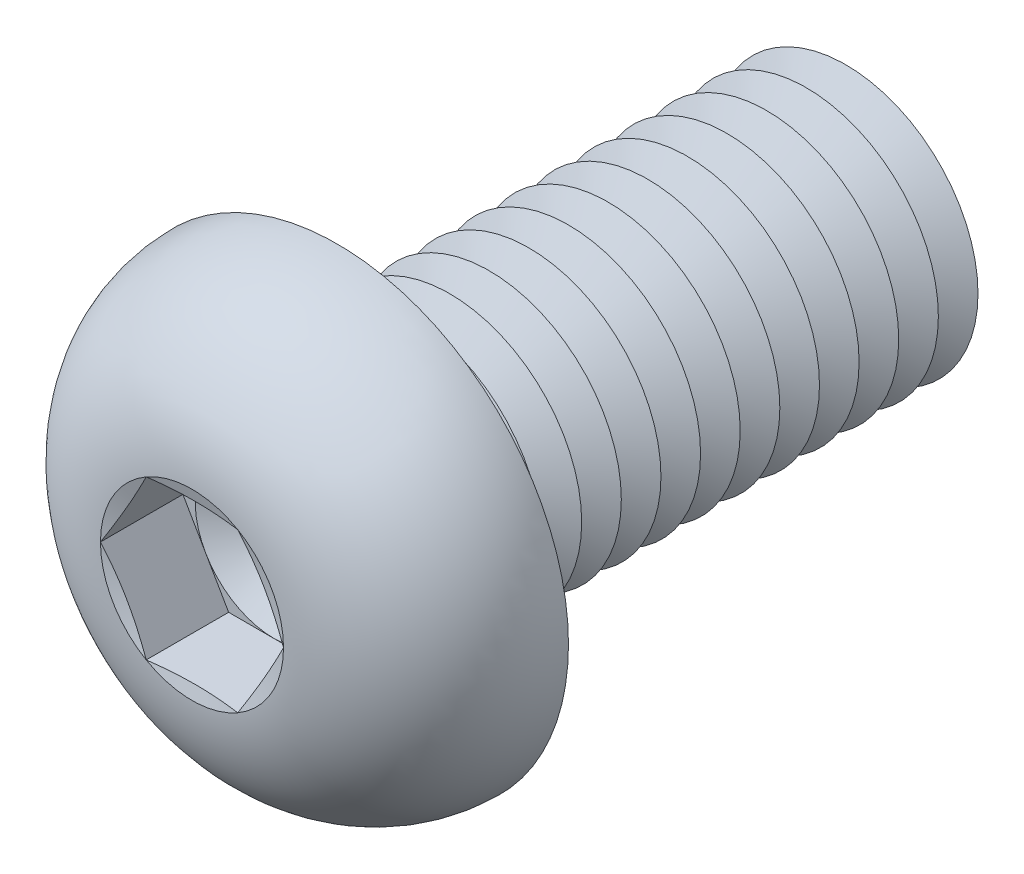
from build123d import *

# Parameters (mm, degrees)
FILLET1_R          = 0.75
LPATTERN1_COUNT    = 13
LPATTERN1_PITCH    = 1.5
CUT_EXTRUDE1_DEPTH = 3.12


with BuildPart() as part:
    # Sketch1 → Revolve1 (revolve)
    with BuildSketch(Plane(origin=(0, 0, 0), x_dir=(0, 0, -1), z_dir=(1, 0, 0)), mode=Mode.PRIVATE) as revolve1_sk:
        with BuildLine():
            Line((0, 5), (0, 8.75))
            ThreePointArc((0, 8.75), (-3.814142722, 7.21429474), (-5.5, 3.4641))
            Line((-5.5, 3.4641), (-5.035898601, 1.73205))
            Line((-5.035898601, 1.73205), (-5.5, 1.73205))
            Line((-5.5, 1.73205), (-5.5, 0))
            Line((-5.5, 0), (20, 0))
            Line((20, 0), (20, 5))
            Line((20, 5), (0, 5))
        make_face()
    revolve(revolve1_sk.sketch.rotate(Axis((0, 0, -20), (0, 0, 1)), 90), axis=Axis((0, 0, -20), (0, 0, 1)))

    # Fillet1
    fillet1_edges = [part.edges().sort_by_distance(p)[0] for p in [
        (5, 0, 0),
    ]]
    fillet(fillet1_edges, radius=FILLET1_R)

    # Sketch2 → Cut-Revolve1 (revolve, cut)
    with BuildSketch(Plane(origin=(0, 0, 0), x_dir=(0, 0, -1), z_dir=(1, 0, 0)), mode=Mode.PRIVATE) as cut_revolve1_sk:
        Polygon((19.25, 5), (20.75, 5), (20, 3.700961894), align=None)
    cut_revolve1 = revolve(cut_revolve1_sk.sketch.rotate(Axis((0, 0, -20), (0, 0, -1)), 270), axis=Axis((0, 0, -20), (0, 0, -1)), mode=Mode.SUBTRACT)

    # LPattern1: Cut-Revolve1 ×13
    with Locations(*[(0, 0, i * LPATTERN1_PITCH) for i in range(1, LPATTERN1_COUNT)]):
        add(cut_revolve1, mode=Mode.SUBTRACT)

    # Sketch3 → Cut-Extrude1 (cut)
    with BuildSketch(Plane.XY.offset(5.5)):
        Polygon((1.73205, 2.999998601), (-1.73205, 2.999998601), (-3.4641, 0), (-1.73205, -2.999998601), (1.73205, -2.999998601), (3.4641, 0), align=None)
    extrude(amount=-CUT_EXTRUDE1_DEPTH, mode=Mode.SUBTRACT)

    # Cut-Extrude2 cone 1 section (on through the dimple's axis) → Cut-Extrude2 (revolve, cut)
    with BuildSketch(Plane(origin=(0, 0, 2.38), x_dir=(0, -1, 0), z_dir=(1, 0, 0))):
        Polygon((0, 0), (2.999998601, 0), (0, 1.73205), align=None)
    revolve(axis=Axis((0, 0, 2.38), (0, 0, -1)), mode=Mode.SUBTRACT)


solid = part.part
